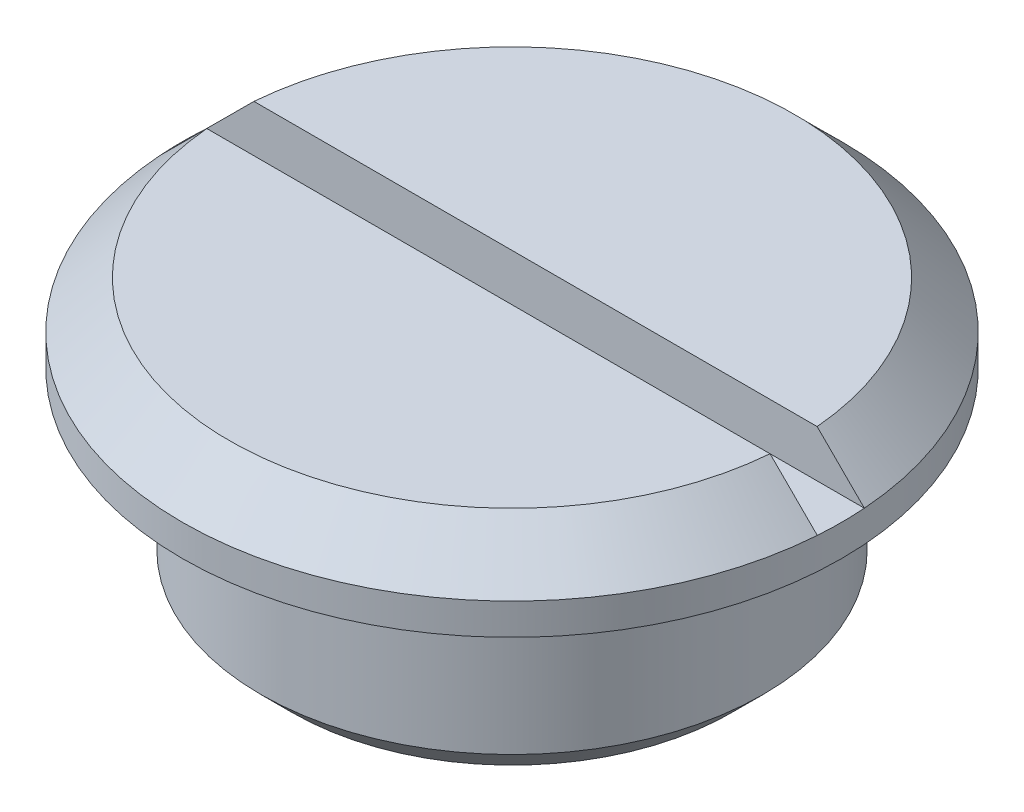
ISO-10303-21;
HEADER;
FILE_DESCRIPTION(('STEP AP214'),'2;1');
FILE_NAME('part.step','',(''),(''),'','','');
FILE_SCHEMA(('AUTOMOTIVE_DESIGN { 1 0 10303 214 1 1 1 1 }'));
ENDSEC;
DATA;
#1=APPLICATION_CONTEXT('core data for automotive mechanical design processes');
#2=APPLICATION_PROTOCOL_DEFINITION('international standard','automotive_design',2000,#1);
#3=PRODUCT_CONTEXT('',#1,'mechanical');
#4=PRODUCT('Part','Part','',(#3));
#5=PRODUCT_RELATED_PRODUCT_CATEGORY('part','',(#4));
#6=PRODUCT_DEFINITION_FORMATION('','',#4);
#7=PRODUCT_DEFINITION_CONTEXT('part definition',#1,'design');
#8=PRODUCT_DEFINITION('design','',#6,#7);
#9=PRODUCT_DEFINITION_SHAPE('','',#8);
#10=(LENGTH_UNIT() NAMED_UNIT(*) SI_UNIT(.MILLI.,.METRE.));
#11=(NAMED_UNIT(*) PLANE_ANGLE_UNIT() SI_UNIT($,.RADIAN.));
#12=(NAMED_UNIT(*) SI_UNIT($,.STERADIAN.) SOLID_ANGLE_UNIT());
#13=UNCERTAINTY_MEASURE_WITH_UNIT(LENGTH_MEASURE(1.E-05),#10,'distance_accuracy_value','');
#14=(GEOMETRIC_REPRESENTATION_CONTEXT(3) GLOBAL_UNCERTAINTY_ASSIGNED_CONTEXT((#13)) GLOBAL_UNIT_ASSIGNED_CONTEXT((#10,
#11,#12)) REPRESENTATION_CONTEXT('',''));
#15=CARTESIAN_POINT('',(0.,0.,0.));
#16=DIRECTION('',(0.,0.,1.));
#17=DIRECTION('',(1.,0.,0.));
#18=AXIS2_PLACEMENT_3D('',#15,#16,#17);
#19=CARTESIAN_POINT('',(-8.99999999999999,8.5,0.));
#20=DIRECTION('',(0.,1.,0.));
#21=DIRECTION('',(0.,0.,1.));
#22=AXIS2_PLACEMENT_3D('',#19,#20,#21);
#23=PLANE('',#22);
#24=DIRECTION('',(1.,0.,0.));
#25=VECTOR('',#24,1.);
#26=CARTESIAN_POINT('',(10.5,8.5,0.75));
#27=LINE('',#26,#25);
#28=CARTESIAN_POINT('',(-8.96869555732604,8.5,0.75));
#29=VERTEX_POINT('',#28);
#30=CARTESIAN_POINT('',(8.96869555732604,8.5,0.75));
#31=VERTEX_POINT('',#30);
#32=EDGE_CURVE('E47',#29,#31,#27,.T.);
#33=ORIENTED_EDGE('',*,*,#32,.F.);
#34=CARTESIAN_POINT('',(0.,8.5,0.));
#35=DIRECTION('',(0.,1.,0.));
#36=DIRECTION('',(0.,0.,1.));
#37=AXIS2_PLACEMENT_3D('',#34,#35,#36);
#38=CIRCLE('',#37,8.99999999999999);
#39=EDGE_CURVE('E93',#29,#31,#38,.T.);
#40=ORIENTED_EDGE('',*,*,#39,.T.);
#41=EDGE_LOOP('',(#33,#40));
#42=FACE_BOUND('',#41,.T.);
#43=ADVANCED_FACE('F29',(#42),#23,.T.);
#44=CARTESIAN_POINT('',(0.,8.5,0.));
#45=DIRECTION('',(0.,-1.,0.));
#46=DIRECTION('',(0.,0.,-1.));
#47=AXIS2_PLACEMENT_3D('',#44,#45,#46);
#48=CONICAL_SURFACE('',#47,8.99999999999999,0.78539816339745);
#49=CARTESIAN_POINT('',(-17.3162966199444,0.167469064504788,0.75));
#50=CARTESIAN_POINT('',(-16.6613026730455,0.821842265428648,0.75));
#51=CARTESIAN_POINT('',(-16.0062807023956,1.47618743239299,0.75));
#52=CARTESIAN_POINT('',(-14.6961395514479,2.78477209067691,0.75));
#53=CARTESIAN_POINT('',(-14.041020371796,3.43901158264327,0.75));
#54=CARTESIAN_POINT('',(-12.7306468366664,4.74733209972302,0.75));
#55=CARTESIAN_POINT('',(-12.0753924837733,5.40141312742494,0.75));
#56=CARTESIAN_POINT('',(-10.7646463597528,6.70934541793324,0.75));
#57=CARTESIAN_POINT('',(-10.1091545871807,7.36319667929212,0.75));
#58=CARTESIAN_POINT('',(-9.12559418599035,8.34367360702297,0.75));
#59=CARTESIAN_POINT('',(-8.79768098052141,8.67045517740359,0.75));
#60=CARTESIAN_POINT('',(-8.14170933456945,9.32387093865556,0.75));
#61=CARTESIAN_POINT('',(-7.81365089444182,9.65050512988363,0.75));
#62=CARTESIAN_POINT('',(-7.15733008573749,10.3035561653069,0.75));
#63=CARTESIAN_POINT('',(-6.82906772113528,10.6299730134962,0.75));
#64=CARTESIAN_POINT('',(-6.1722239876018,11.2824914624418,0.75));
#65=CARTESIAN_POINT('',(-5.84364261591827,11.6085930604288,0.75));
#66=CARTESIAN_POINT('',(-5.35037038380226,12.0973634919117,0.75));
#67=CARTESIAN_POINT('',(-5.18587413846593,12.2602287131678,0.75));
#68=CARTESIAN_POINT('',(-4.85670864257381,12.5857834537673,0.75));
#69=CARTESIAN_POINT('',(-4.69203939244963,12.748472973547,0.75));
#70=CARTESIAN_POINT('',(-4.3624712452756,13.0736098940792,0.75));
#71=CARTESIAN_POINT('',(-4.19757235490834,13.2360573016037,0.75));
#72=CARTESIAN_POINT('',(-3.86744490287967,13.5606199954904,0.75));
#73=CARTESIAN_POINT('',(-3.70221633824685,13.7227352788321,0.75));
#74=CARTESIAN_POINT('',(-3.3712614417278,14.0464910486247,0.75));
#75=CARTESIAN_POINT('',(-3.20553506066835,14.2081314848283,0.75));
#76=CARTESIAN_POINT('',(-2.87334979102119,14.5306512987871,0.75));
#77=CARTESIAN_POINT('',(-2.70689092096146,14.6915306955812,0.75));
#78=CARTESIAN_POINT('',(-2.45626378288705,14.9318915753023,0.75));
#79=CARTESIAN_POINT('',(-2.37255991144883,15.0118569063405,0.75));
#80=CARTESIAN_POINT('',(-2.20472986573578,15.1713410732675,0.75));
#81=CARTESIAN_POINT('',(-2.12060369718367,15.2508599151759,0.75));
#82=CARTESIAN_POINT('',(-1.95177142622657,15.409296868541,0.75));
#83=CARTESIAN_POINT('',(-1.86706527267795,15.4882149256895,0.75));
#84=CARTESIAN_POINT('',(-1.69679147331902,15.6451230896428,0.75));
#85=CARTESIAN_POINT('',(-1.61122378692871,15.7231131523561,0.75));
#86=CARTESIAN_POINT('',(-1.52508482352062,15.8004754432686,0.75));
#87=B_SPLINE_CURVE_WITH_KNOTS('',3,(#49,#50,#51,#52,#53,#54,#55,#56,#57,#58,#59,#60,#61,#62,#63,
#64,#65,#66,#67,#68,#69,#70,#71,#72,#73,#74,#75,#76,#77,#78,#79,#80,#81,#82,#83,#84,#85,#86),
.UNSPECIFIED.,.F.,.F.,(4,2,2,2,2,2,2,2,2,2,2,2,2,2,2,2,2,2,4),(0.,2.77758749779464,
5.55515729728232,8.33267816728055,11.1102162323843,12.499035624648,13.8878516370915,
15.2766413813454,16.6654432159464,17.3598902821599,18.0543356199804,18.7487611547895,
19.4431929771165,20.1376958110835,20.8321811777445,21.1794652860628,21.5267447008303,
21.8740551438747,22.2213820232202),.UNSPECIFIED.);
#88=CARTESIAN_POINT('',(-10.4731800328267,7.,0.75));
#89=VERTEX_POINT('',#88);
#90=EDGE_CURVE('E11',#89,#29,#87,.T.);
#91=ORIENTED_EDGE('',*,*,#90,.F.);
#92=CARTESIAN_POINT('',(0.,6.99999999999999,0.));
#93=DIRECTION('',(0.,1.,0.));
#94=DIRECTION('',(0.,0.,1.));
#95=AXIS2_PLACEMENT_3D('',#92,#93,#94);
#96=CIRCLE('',#95,10.5);
#97=CARTESIAN_POINT('',(10.4731800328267,7.,0.75));
#98=VERTEX_POINT('',#97);
#99=EDGE_CURVE('E83',#89,#98,#96,.T.);
#100=ORIENTED_EDGE('',*,*,#99,.T.);
#101=CARTESIAN_POINT('',(1.52508482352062,15.8004754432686,0.75));
#102=CARTESIAN_POINT('',(1.58685346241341,15.7450264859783,0.75));
#103=CARTESIAN_POINT('',(1.64831529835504,15.6892386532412,0.75));
#104=CARTESIAN_POINT('',(1.77074867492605,15.5771306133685,0.75));
#105=CARTESIAN_POINT('',(1.83172022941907,15.5208104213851,0.75));
#106=CARTESIAN_POINT('',(1.95329518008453,15.4077842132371,0.75));
#107=CARTESIAN_POINT('',(2.01389860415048,15.3510782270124,0.75));
#108=CARTESIAN_POINT('',(2.13481969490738,15.2373615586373,0.75));
#109=CARTESIAN_POINT('',(2.19513735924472,15.1803508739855,0.75));
#110=CARTESIAN_POINT('',(2.37574157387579,15.0089773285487,0.75));
#111=CARTESIAN_POINT('',(2.49569238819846,14.8942607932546,0.75));
#112=CARTESIAN_POINT('',(2.73500693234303,14.6642122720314,0.75));
#113=CARTESIAN_POINT('',(2.85437064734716,14.5488802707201,0.75));
#114=CARTESIAN_POINT('',(3.21178309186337,14.2023342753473,0.75));
#115=CARTESIAN_POINT('',(3.44922840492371,13.9704983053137,0.75));
#116=CARTESIAN_POINT('',(3.92326836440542,13.5059580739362,0.75));
#117=CARTESIAN_POINT('',(4.15986300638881,13.2732538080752,0.75));
#118=CARTESIAN_POINT('',(4.63253168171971,12.8073177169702,0.75));
#119=CARTESIAN_POINT('',(4.86860571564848,12.5740858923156,0.75));
#120=CARTESIAN_POINT('',(5.34041768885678,12.1072824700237,0.75));
#121=CARTESIAN_POINT('',(5.57615562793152,11.8737108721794,0.75));
#122=CARTESIAN_POINT('',(6.28307826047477,11.1726093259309,0.75));
#123=CARTESIAN_POINT('',(6.75392507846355,10.7047387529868,0.75));
#124=CARTESIAN_POINT('',(7.69515277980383,9.76853240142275,0.75));
#125=CARTESIAN_POINT('',(8.16553366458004,9.30019662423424,0.75));
#126=CARTESIAN_POINT('',(8.77207744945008,8.69592670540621,0.75));
#127=CARTESIAN_POINT('',(8.90836936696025,8.5601220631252,0.75));
#128=CARTESIAN_POINT('',(9.18092902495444,8.28849462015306,0.75));
#129=CARTESIAN_POINT('',(9.31719676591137,8.15267181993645,0.75));
#130=CARTESIAN_POINT('',(10.109115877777,7.36323470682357,0.75));
#131=CARTESIAN_POINT('',(10.7645694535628,6.7094219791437,0.75));
#132=CARTESIAN_POINT('',(12.0752430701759,5.40156239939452,0.75));
#133=CARTESIAN_POINT('',(12.730463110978,4.7475155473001,0.75));
#134=CARTESIAN_POINT('',(14.0408408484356,3.43919081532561,0.75));
#135=CARTESIAN_POINT('',(14.6959985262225,2.78491291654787,0.75));
#136=CARTESIAN_POINT('',(16.0062123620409,1.47625572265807,0.75));
#137=CARTESIAN_POINT('',(16.6612685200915,0.821876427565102,0.75));
#138=CARTESIAN_POINT('',(17.3162966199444,0.167469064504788,0.75));
#139=B_SPLINE_CURVE_WITH_KNOTS('',3,(#101,#102,#103,#104,#105,#106,#107,#108,#109,#110,#111,
#112,#113,#114,#115,#116,#117,#118,#119,#120,#121,#122,#123,#124,#125,#126,#127,#128,#129,#130,
#131,#132,#133,#134,#135,#136,#137,#138),.UNSPECIFIED.,.F.,.F.,(4,2,2,2,2,2,2,2,2,2,2,2,2,2,2,2,
2,2,4),(0.,0.249013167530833,0.498019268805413,0.747006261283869,0.995995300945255,
1.49391983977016,1.99185688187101,2.98741849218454,3.9829852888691,4.97855097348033,
5.97411726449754,7.96544674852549,9.95677012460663,10.5339750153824,11.1111669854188,
13.888542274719,16.6659178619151,19.4436508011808,22.2213832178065),.UNSPECIFIED.);
#140=EDGE_CURVE('E41',#31,#98,#139,.T.);
#141=ORIENTED_EDGE('',*,*,#140,.F.);
#142=ORIENTED_EDGE('',*,*,#39,.F.);
#143=EDGE_LOOP('',(#91,#100,#141,#142));
#144=FACE_BOUND('',#143,.T.);
#145=ADVANCED_FACE('F90',(#144),#48,.T.);
#146=DIRECTION('',(-1.,0.,0.));
#147=VECTOR('',#146,1.);
#148=CARTESIAN_POINT('',(10.5,8.5,-0.75));
#149=LINE('',#148,#147);
#150=CARTESIAN_POINT('',(8.96869555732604,8.5,-0.75));
#151=VERTEX_POINT('',#150);
#152=CARTESIAN_POINT('',(-8.96869555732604,8.5,-0.75));
#153=VERTEX_POINT('',#152);
#154=EDGE_CURVE('E167',#151,#153,#149,.T.);
#155=ORIENTED_EDGE('',*,*,#154,.F.);
#156=EDGE_CURVE('E101',#151,#153,#38,.T.);
#157=ORIENTED_EDGE('',*,*,#156,.T.);
#158=EDGE_LOOP('',(#155,#157));
#159=FACE_BOUND('',#158,.T.);
#160=ADVANCED_FACE('F31',(#159),#23,.T.);
#161=CARTESIAN_POINT('',(-1.52508482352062,15.8004754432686,-0.75));
#162=CARTESIAN_POINT('',(-1.58685346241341,15.7450264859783,-0.75));
#163=CARTESIAN_POINT('',(-1.64831529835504,15.6892386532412,-0.75));
#164=CARTESIAN_POINT('',(-1.77074867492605,15.5771306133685,-0.75));
#165=CARTESIAN_POINT('',(-1.83172022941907,15.5208104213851,-0.75));
#166=CARTESIAN_POINT('',(-1.95329518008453,15.4077842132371,-0.75));
#167=CARTESIAN_POINT('',(-2.01389860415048,15.3510782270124,-0.75));
#168=CARTESIAN_POINT('',(-2.13481969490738,15.2373615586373,-0.75));
#169=CARTESIAN_POINT('',(-2.19513735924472,15.1803508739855,-0.75));
#170=CARTESIAN_POINT('',(-2.37574157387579,15.0089773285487,-0.75));
#171=CARTESIAN_POINT('',(-2.49569238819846,14.8942607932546,-0.75));
#172=CARTESIAN_POINT('',(-2.73500693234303,14.6642122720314,-0.75));
#173=CARTESIAN_POINT('',(-2.85437064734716,14.5488802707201,-0.75));
#174=CARTESIAN_POINT('',(-3.21178309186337,14.2023342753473,-0.75));
#175=CARTESIAN_POINT('',(-3.44922840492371,13.9704983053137,-0.75));
#176=CARTESIAN_POINT('',(-3.92326836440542,13.5059580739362,-0.75));
#177=CARTESIAN_POINT('',(-4.15986300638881,13.2732538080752,-0.75));
#178=CARTESIAN_POINT('',(-4.63253168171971,12.8073177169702,-0.75));
#179=CARTESIAN_POINT('',(-4.86860571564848,12.5740858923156,-0.75));
#180=CARTESIAN_POINT('',(-5.34041768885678,12.1072824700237,-0.75));
#181=CARTESIAN_POINT('',(-5.57615562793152,11.8737108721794,-0.75));
#182=CARTESIAN_POINT('',(-6.28307826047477,11.1726093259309,-0.75));
#183=CARTESIAN_POINT('',(-6.75392507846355,10.7047387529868,-0.75));
#184=CARTESIAN_POINT('',(-7.69515277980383,9.76853240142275,-0.75));
#185=CARTESIAN_POINT('',(-8.16553366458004,9.30019662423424,-0.75));
#186=CARTESIAN_POINT('',(-8.77207744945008,8.69592670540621,-0.75));
#187=CARTESIAN_POINT('',(-8.90836936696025,8.5601220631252,-0.75));
#188=CARTESIAN_POINT('',(-9.18092902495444,8.28849462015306,-0.75));
#189=CARTESIAN_POINT('',(-9.31719676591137,8.15267181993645,-0.75));
#190=CARTESIAN_POINT('',(-10.109115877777,7.36323470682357,-0.75));
#191=CARTESIAN_POINT('',(-10.7645694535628,6.7094219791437,-0.75));
#192=CARTESIAN_POINT('',(-12.0752430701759,5.40156239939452,-0.75));
#193=CARTESIAN_POINT('',(-12.730463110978,4.7475155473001,-0.75));
#194=CARTESIAN_POINT('',(-14.0408408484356,3.43919081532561,-0.75));
#195=CARTESIAN_POINT('',(-14.6959985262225,2.78491291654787,-0.75));
#196=CARTESIAN_POINT('',(-16.0062123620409,1.47625572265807,-0.75));
#197=CARTESIAN_POINT('',(-16.6612685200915,0.821876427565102,-0.75));
#198=CARTESIAN_POINT('',(-17.3162966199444,0.167469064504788,-0.75));
#199=B_SPLINE_CURVE_WITH_KNOTS('',3,(#161,#162,#163,#164,#165,#166,#167,#168,#169,#170,#171,
#172,#173,#174,#175,#176,#177,#178,#179,#180,#181,#182,#183,#184,#185,#186,#187,#188,#189,#190,
#191,#192,#193,#194,#195,#196,#197,#198),.UNSPECIFIED.,.F.,.F.,(4,2,2,2,2,2,2,2,2,2,2,2,2,2,2,2,
2,2,4),(0.,0.249013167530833,0.498019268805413,0.747006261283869,0.995995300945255,
1.49391983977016,1.99185688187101,2.98741849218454,3.9829852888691,4.97855097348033,
5.97411726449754,7.96544674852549,9.95677012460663,10.5339750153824,11.1111669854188,
13.888542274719,16.6659178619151,19.4436508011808,22.2213832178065),.UNSPECIFIED.);
#200=CARTESIAN_POINT('',(-10.4731800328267,7.,-0.75));
#201=VERTEX_POINT('',#200);
#202=EDGE_CURVE('E107',#153,#201,#199,.T.);
#203=ORIENTED_EDGE('',*,*,#202,.F.);
#204=ORIENTED_EDGE('',*,*,#156,.F.);
#205=CARTESIAN_POINT('',(17.3162966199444,0.167469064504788,-0.75));
#206=CARTESIAN_POINT('',(16.6613026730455,0.821842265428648,-0.75));
#207=CARTESIAN_POINT('',(16.0062807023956,1.47618743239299,-0.75));
#208=CARTESIAN_POINT('',(14.6961395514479,2.78477209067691,-0.75));
#209=CARTESIAN_POINT('',(14.041020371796,3.43901158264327,-0.75));
#210=CARTESIAN_POINT('',(12.7306468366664,4.74733209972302,-0.75));
#211=CARTESIAN_POINT('',(12.0753924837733,5.40141312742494,-0.75));
#212=CARTESIAN_POINT('',(10.7646463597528,6.70934541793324,-0.75));
#213=CARTESIAN_POINT('',(10.1091545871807,7.36319667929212,-0.75));
#214=CARTESIAN_POINT('',(9.12559418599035,8.34367360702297,-0.75));
#215=CARTESIAN_POINT('',(8.79768098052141,8.67045517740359,-0.75));
#216=CARTESIAN_POINT('',(8.14170933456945,9.32387093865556,-0.75));
#217=CARTESIAN_POINT('',(7.81365089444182,9.65050512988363,-0.75));
#218=CARTESIAN_POINT('',(7.15733008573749,10.3035561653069,-0.75));
#219=CARTESIAN_POINT('',(6.82906772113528,10.6299730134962,-0.75));
#220=CARTESIAN_POINT('',(6.1722239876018,11.2824914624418,-0.75));
#221=CARTESIAN_POINT('',(5.84364261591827,11.6085930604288,-0.75));
#222=CARTESIAN_POINT('',(5.35037038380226,12.0973634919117,-0.75));
#223=CARTESIAN_POINT('',(5.18587413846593,12.2602287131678,-0.75));
#224=CARTESIAN_POINT('',(4.85670864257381,12.5857834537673,-0.75));
#225=CARTESIAN_POINT('',(4.69203939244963,12.748472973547,-0.75));
#226=CARTESIAN_POINT('',(4.3624712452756,13.0736098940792,-0.75));
#227=CARTESIAN_POINT('',(4.19757235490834,13.2360573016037,-0.75));
#228=CARTESIAN_POINT('',(3.86744490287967,13.5606199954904,-0.75));
#229=CARTESIAN_POINT('',(3.70221633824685,13.7227352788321,-0.75));
#230=CARTESIAN_POINT('',(3.3712614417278,14.0464910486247,-0.75));
#231=CARTESIAN_POINT('',(3.20553506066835,14.2081314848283,-0.75));
#232=CARTESIAN_POINT('',(2.87334979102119,14.5306512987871,-0.75));
#233=CARTESIAN_POINT('',(2.70689092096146,14.6915306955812,-0.75));
#234=CARTESIAN_POINT('',(2.45626378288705,14.9318915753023,-0.75));
#235=CARTESIAN_POINT('',(2.37255991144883,15.0118569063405,-0.75));
#236=CARTESIAN_POINT('',(2.20472986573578,15.1713410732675,-0.75));
#237=CARTESIAN_POINT('',(2.12060369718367,15.2508599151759,-0.75));
#238=CARTESIAN_POINT('',(1.95177142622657,15.409296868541,-0.75));
#239=CARTESIAN_POINT('',(1.86706527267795,15.4882149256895,-0.75));
#240=CARTESIAN_POINT('',(1.69679147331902,15.6451230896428,-0.75));
#241=CARTESIAN_POINT('',(1.61122378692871,15.7231131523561,-0.75));
#242=CARTESIAN_POINT('',(1.52508482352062,15.8004754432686,-0.75));
#243=B_SPLINE_CURVE_WITH_KNOTS('',3,(#205,#206,#207,#208,#209,#210,#211,#212,#213,#214,#215,
#216,#217,#218,#219,#220,#221,#222,#223,#224,#225,#226,#227,#228,#229,#230,#231,#232,#233,#234,
#235,#236,#237,#238,#239,#240,#241,#242),.UNSPECIFIED.,.F.,.F.,(4,2,2,2,2,2,2,2,2,2,2,2,2,2,2,2,
2,2,4),(0.,2.77758749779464,5.55515729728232,8.33267816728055,11.1102162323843,12.499035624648,
13.8878516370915,15.2766413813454,16.6654432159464,17.3598902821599,18.0543356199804,
18.7487611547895,19.4431929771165,20.1376958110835,20.8321811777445,21.1794652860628,
21.5267447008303,21.8740551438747,22.2213820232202),.UNSPECIFIED.);
#244=CARTESIAN_POINT('',(10.4731800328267,7.,-0.75));
#245=VERTEX_POINT('',#244);
#246=EDGE_CURVE('E109',#245,#151,#243,.T.);
#247=ORIENTED_EDGE('',*,*,#246,.F.);
#248=EDGE_CURVE('E82',#245,#201,#96,.T.);
#249=ORIENTED_EDGE('',*,*,#248,.T.);
#250=EDGE_LOOP('',(#203,#204,#247,#249));
#251=FACE_BOUND('',#250,.T.);
#252=ADVANCED_FACE('F105',(#251),#48,.T.);
#253=CARTESIAN_POINT('',(0.,46.,0.));
#254=DIRECTION('',(0.,1.,0.));
#255=DIRECTION('',(0.,0.,1.));
#256=AXIS2_PLACEMENT_3D('',#253,#254,#255);
#257=CYLINDRICAL_SURFACE('',#256,10.5);
#258=CARTESIAN_POINT('',(0.,6.,0.));
#259=DIRECTION('',(0.,1.,0.));
#260=DIRECTION('',(0.,0.,1.));
#261=AXIS2_PLACEMENT_3D('',#258,#259,#260);
#262=CIRCLE('',#261,10.5);
#263=CARTESIAN_POINT('',(0.,6.,10.5));
#264=VERTEX_POINT('',#263);
#265=EDGE_CURVE('E96',#264,#264,#262,.T.);
#266=ORIENTED_EDGE('',*,*,#265,.T.);
#267=EDGE_LOOP('',(#266));
#268=FACE_BOUND('',#267,.T.);
#269=EDGE_CURVE('E95',#98,#245,#96,.T.);
#270=ORIENTED_EDGE('',*,*,#269,.F.);
#271=ORIENTED_EDGE('',*,*,#99,.F.);
#272=EDGE_CURVE('E72',#201,#89,#96,.T.);
#273=ORIENTED_EDGE('',*,*,#272,.F.);
#274=ORIENTED_EDGE('',*,*,#248,.F.);
#275=EDGE_LOOP('',(#270,#271,#273,#274));
#276=FACE_BOUND('',#275,.T.);
#277=ADVANCED_FACE('F94',(#268,#276),#257,.T.);
#278=CARTESIAN_POINT('',(-6.75,6.,0.));
#279=DIRECTION('',(0.,-1.,0.));
#280=DIRECTION('',(0.,0.,-1.));
#281=AXIS2_PLACEMENT_3D('',#278,#279,#280);
#282=PLANE('',#281);
#283=CARTESIAN_POINT('',(0.,6.,0.));
#284=DIRECTION('',(0.,1.,0.));
#285=DIRECTION('',(0.,0.,1.));
#286=AXIS2_PLACEMENT_3D('',#283,#284,#285);
#287=CIRCLE('',#286,6.75);
#288=CARTESIAN_POINT('',(0.,6.,6.75));
#289=VERTEX_POINT('',#288);
#290=EDGE_CURVE('E98',#289,#289,#287,.T.);
#291=ORIENTED_EDGE('',*,*,#290,.T.);
#292=EDGE_LOOP('',(#291));
#293=FACE_BOUND('',#292,.T.);
#294=ORIENTED_EDGE('',*,*,#265,.F.);
#295=EDGE_LOOP('',(#294));
#296=FACE_BOUND('',#295,.T.);
#297=ADVANCED_FACE('F149',(#293,#296),#282,.T.);
#298=CARTESIAN_POINT('',(0.,46.,0.));
#299=DIRECTION('',(0.,1.,0.));
#300=DIRECTION('',(0.,0.,1.));
#301=AXIS2_PLACEMENT_3D('',#298,#299,#300);
#302=CYLINDRICAL_SURFACE('',#301,6.75);
#303=CARTESIAN_POINT('',(0.,4.75,0.));
#304=DIRECTION('',(0.,1.,0.));
#305=DIRECTION('',(0.,0.,1.));
#306=AXIS2_PLACEMENT_3D('',#303,#304,#305);
#307=CIRCLE('',#306,6.75);
#308=CARTESIAN_POINT('',(0.,4.75,6.75));
#309=VERTEX_POINT('',#308);
#310=EDGE_CURVE('E180',#309,#309,#307,.T.);
#311=ORIENTED_EDGE('',*,*,#310,.T.);
#312=EDGE_LOOP('',(#311));
#313=FACE_BOUND('',#312,.T.);
#314=ORIENTED_EDGE('',*,*,#290,.F.);
#315=EDGE_LOOP('',(#314));
#316=FACE_BOUND('',#315,.T.);
#317=ADVANCED_FACE('F145',(#313,#316),#302,.T.);
#318=CARTESIAN_POINT('',(-7.99999999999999,4.75,0.));
#319=DIRECTION('',(0.,1.,0.));
#320=DIRECTION('',(0.,0.,1.));
#321=AXIS2_PLACEMENT_3D('',#318,#319,#320);
#322=PLANE('',#321);
#323=CARTESIAN_POINT('',(0.,4.75,0.));
#324=DIRECTION('',(0.,1.,0.));
#325=DIRECTION('',(0.,0.,1.));
#326=AXIS2_PLACEMENT_3D('',#323,#324,#325);
#327=CIRCLE('',#326,7.99999999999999);
#328=CARTESIAN_POINT('',(0.,4.75,7.99999999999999));
#329=VERTEX_POINT('',#328);
#330=EDGE_CURVE('E177',#329,#329,#327,.T.);
#331=ORIENTED_EDGE('',*,*,#330,.T.);
#332=EDGE_LOOP('',(#331));
#333=FACE_BOUND('',#332,.T.);
#334=ORIENTED_EDGE('',*,*,#310,.F.);
#335=EDGE_LOOP('',(#334));
#336=FACE_BOUND('',#335,.T.);
#337=ADVANCED_FACE('F141',(#333,#336),#322,.T.);
#338=CARTESIAN_POINT('',(0.,46.,0.));
#339=DIRECTION('',(0.,1.,0.));
#340=DIRECTION('',(0.,0.,1.));
#341=AXIS2_PLACEMENT_3D('',#338,#339,#340);
#342=CYLINDRICAL_SURFACE('',#341,7.99999999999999);
#343=CARTESIAN_POINT('',(0.,0.999999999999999,0.));
#344=DIRECTION('',(0.,1.,0.));
#345=DIRECTION('',(0.,0.,1.));
#346=AXIS2_PLACEMENT_3D('',#343,#344,#345);
#347=CIRCLE('',#346,7.99999999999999);
#348=CARTESIAN_POINT('',(0.,0.999999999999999,7.99999999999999));
#349=VERTEX_POINT('',#348);
#350=EDGE_CURVE('E174',#349,#349,#347,.T.);
#351=ORIENTED_EDGE('',*,*,#350,.T.);
#352=EDGE_LOOP('',(#351));
#353=FACE_BOUND('',#352,.T.);
#354=ORIENTED_EDGE('',*,*,#330,.F.);
#355=EDGE_LOOP('',(#354));
#356=FACE_BOUND('',#355,.T.);
#357=ADVANCED_FACE('F137',(#353,#356),#342,.T.);
#358=CARTESIAN_POINT('',(0.,0.999999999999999,0.));
#359=DIRECTION('',(0.,1.,0.));
#360=DIRECTION('',(0.,0.,1.));
#361=AXIS2_PLACEMENT_3D('',#358,#359,#360);
#362=CONICAL_SURFACE('',#361,7.99999999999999,0.78539816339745);
#363=CARTESIAN_POINT('',(0.,0.,0.));
#364=DIRECTION('',(0.,1.,0.));
#365=DIRECTION('',(0.,0.,1.));
#366=AXIS2_PLACEMENT_3D('',#363,#364,#365);
#367=CIRCLE('',#366,6.99999999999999);
#368=CARTESIAN_POINT('',(0.,0.,6.99999999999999));
#369=VERTEX_POINT('',#368);
#370=EDGE_CURVE('E86',#369,#369,#367,.T.);
#371=ORIENTED_EDGE('',*,*,#370,.T.);
#372=EDGE_LOOP('',(#371));
#373=FACE_BOUND('',#372,.T.);
#374=ORIENTED_EDGE('',*,*,#350,.F.);
#375=EDGE_LOOP('',(#374));
#376=FACE_BOUND('',#375,.T.);
#377=ADVANCED_FACE('F133',(#373,#376),#362,.T.);
#378=CARTESIAN_POINT('',(0.,0.,0.));
#379=DIRECTION('',(0.,-1.,0.));
#380=DIRECTION('',(0.,0.,-1.));
#381=AXIS2_PLACEMENT_3D('',#378,#379,#380);
#382=PLANE('',#381);
#383=ORIENTED_EDGE('',*,*,#370,.F.);
#384=EDGE_LOOP('',(#383));
#385=FACE_BOUND('',#384,.T.);
#386=ADVANCED_FACE('F129',(#385),#382,.T.);
#387=CARTESIAN_POINT('',(10.5,7.,0.75));
#388=DIRECTION('',(0.,0.,1.));
#389=DIRECTION('',(1.,0.,0.));
#390=AXIS2_PLACEMENT_3D('',#387,#388,#389);
#391=PLANE('',#390);
#392=ORIENTED_EDGE('',*,*,#90,.T.);
#393=ORIENTED_EDGE('',*,*,#32,.T.);
#394=ORIENTED_EDGE('',*,*,#140,.T.);
#395=DIRECTION('',(1.,0.,0.));
#396=VECTOR('',#395,1.);
#397=CARTESIAN_POINT('',(10.5,7.,0.75));
#398=LINE('',#397,#396);
#399=EDGE_CURVE('E74',#89,#98,#398,.T.);
#400=ORIENTED_EDGE('',*,*,#399,.F.);
#401=EDGE_LOOP('',(#392,#393,#394,#400));
#402=FACE_BOUND('',#401,.T.);
#403=ADVANCED_FACE('F85',(#402),#391,.F.);
#404=CARTESIAN_POINT('',(10.5,7.,-0.75));
#405=DIRECTION('',(0.,0.,-1.));
#406=DIRECTION('',(-1.,0.,0.));
#407=AXIS2_PLACEMENT_3D('',#404,#405,#406);
#408=PLANE('',#407);
#409=ORIENTED_EDGE('',*,*,#202,.T.);
#410=DIRECTION('',(-1.,0.,0.));
#411=VECTOR('',#410,1.);
#412=CARTESIAN_POINT('',(10.5,7.,-0.75));
#413=LINE('',#412,#411);
#414=EDGE_CURVE('E77',#245,#201,#413,.T.);
#415=ORIENTED_EDGE('',*,*,#414,.F.);
#416=ORIENTED_EDGE('',*,*,#246,.T.);
#417=ORIENTED_EDGE('',*,*,#154,.T.);
#418=EDGE_LOOP('',(#409,#415,#416,#417));
#419=FACE_BOUND('',#418,.T.);
#420=ADVANCED_FACE('F123',(#419),#408,.F.);
#421=CARTESIAN_POINT('',(10.5,7.,0.75));
#422=DIRECTION('',(0.,-1.,0.));
#423=DIRECTION('',(0.,0.,-1.));
#424=AXIS2_PLACEMENT_3D('',#421,#422,#423);
#425=PLANE('',#424);
#426=ORIENTED_EDGE('',*,*,#272,.T.);
#427=ORIENTED_EDGE('',*,*,#399,.T.);
#428=ORIENTED_EDGE('',*,*,#269,.T.);
#429=ORIENTED_EDGE('',*,*,#414,.T.);
#430=EDGE_LOOP('',(#426,#427,#428,#429));
#431=FACE_BOUND('',#430,.T.);
#432=ADVANCED_FACE('F73',(#431),#425,.F.);
#433=CLOSED_SHELL('',(#43,#145,#160,#252,#277,#297,#317,#337,#357,#377,#386,#403,#420,#432));
#434=MANIFOLD_SOLID_BREP('B2',#433);
#435=ADVANCED_BREP_SHAPE_REPRESENTATION('',(#18,#434),#14);
#436=SHAPE_DEFINITION_REPRESENTATION(#9,#435);
ENDSEC;
END-ISO-10303-21;
